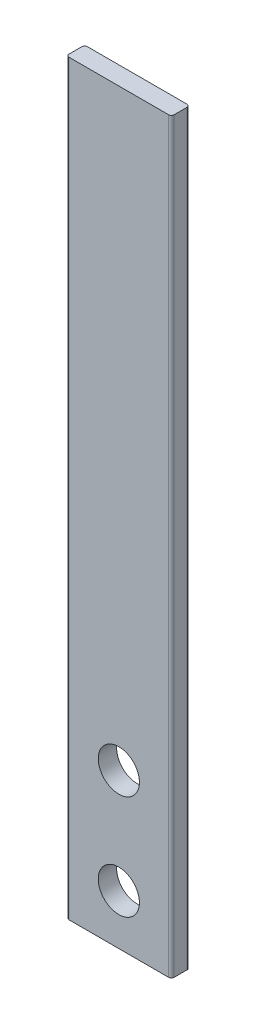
from build123d import *

# Parameters (mm, degrees)
SKETCH2_W           = 9.6012
SKETCH2_H           = 68.2498
BOSS_EXTRUDE1_DEPTH = 1.6764
SKETCH3_R           = 1.8796
CUT_EXTRUDE1_DEPTH  = 35.501664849
FILLET1_R           = 0.254


with BuildPart() as part:
    # Sketch2 → Boss-Extrude1 (new body)
    with BuildSketch(Plane.XY):
        Rectangle(SKETCH2_W, SKETCH2_H)
    extrude(amount=-BOSS_EXTRUDE1_DEPTH)

    # Sketch3 → Cut-Extrude1 (cut, through all)
    with BuildSketch(Plane.XY):
        with Locations((0, -29.5529)):
            Circle(SKETCH3_R)
        with Locations((0, -20.0279)):
            Circle(SKETCH3_R)
    extrude(amount=-CUT_EXTRUDE1_DEPTH, mode=Mode.SUBTRACT)

    # Fillet1
    fillet1_edges = [part.edges().sort_by_distance(p)[0] for p in [
        (-4.8006, 0, -1.6764),
        (4.8006, 0, -1.6764),
        (-4.8006, 0, 0),
        (4.8006, 0, 0),
    ]]
    fillet(fillet1_edges, radius=FILLET1_R)


solid = part.part
